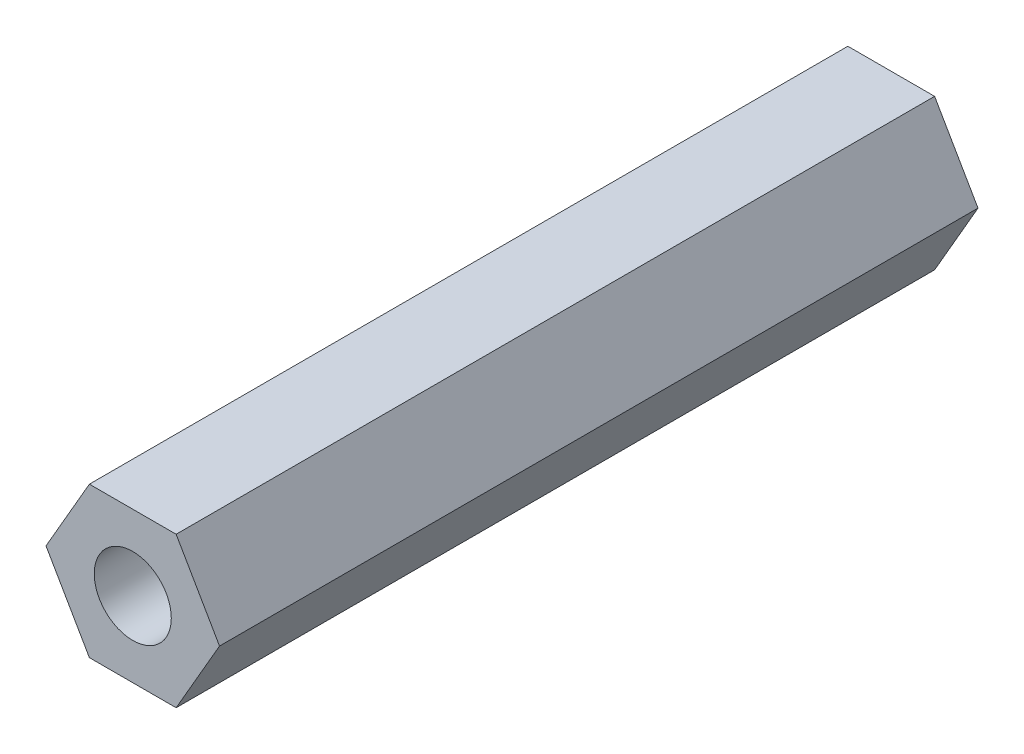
ISO-10303-21;
HEADER;
FILE_DESCRIPTION(('STEP AP214'),'2;1');
FILE_NAME('part.step','',(''),(''),'','','');
FILE_SCHEMA(('AUTOMOTIVE_DESIGN { 1 0 10303 214 1 1 1 1 }'));
ENDSEC;
DATA;
#1=APPLICATION_CONTEXT('core data for automotive mechanical design processes');
#2=APPLICATION_PROTOCOL_DEFINITION('international standard','automotive_design',2000,#1);
#3=PRODUCT_CONTEXT('',#1,'mechanical');
#4=PRODUCT('Part','Part','',(#3));
#5=PRODUCT_RELATED_PRODUCT_CATEGORY('part','',(#4));
#6=PRODUCT_DEFINITION_FORMATION('','',#4);
#7=PRODUCT_DEFINITION_CONTEXT('part definition',#1,'design');
#8=PRODUCT_DEFINITION('design','',#6,#7);
#9=PRODUCT_DEFINITION_SHAPE('','',#8);
#10=(LENGTH_UNIT() NAMED_UNIT(*) SI_UNIT(.MILLI.,.METRE.));
#11=(NAMED_UNIT(*) PLANE_ANGLE_UNIT() SI_UNIT($,.RADIAN.));
#12=(NAMED_UNIT(*) SI_UNIT($,.STERADIAN.) SOLID_ANGLE_UNIT());
#13=UNCERTAINTY_MEASURE_WITH_UNIT(LENGTH_MEASURE(1.E-05),#10,'distance_accuracy_value','');
#14=(GEOMETRIC_REPRESENTATION_CONTEXT(3) GLOBAL_UNCERTAINTY_ASSIGNED_CONTEXT((#13)) GLOBAL_UNIT_ASSIGNED_CONTEXT((#10,
#11,#12)) REPRESENTATION_CONTEXT('',''));
#15=CARTESIAN_POINT('',(0.,0.,0.));
#16=DIRECTION('',(0.,0.,1.));
#17=DIRECTION('',(1.,0.,0.));
#18=AXIS2_PLACEMENT_3D('',#15,#16,#17);
#19=CARTESIAN_POINT('',(2.28769270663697,0.,10.));
#20=DIRECTION('',(-0.866025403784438,-0.5,0.));
#21=DIRECTION('',(0.5,-0.866025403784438,0.));
#22=AXIS2_PLACEMENT_3D('',#19,#20,#21);
#23=PLANE('',#22);
#24=DIRECTION('',(-0.5,0.866025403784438,0.));
#25=VECTOR('',#24,1.);
#26=CARTESIAN_POINT('',(2.28769270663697,0.,-10.));
#27=LINE('',#26,#25);
#28=CARTESIAN_POINT('',(2.28769270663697,0.,-10.));
#29=VERTEX_POINT('',#28);
#30=CARTESIAN_POINT('',(1.14384635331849,1.9812,-10.));
#31=VERTEX_POINT('',#30);
#32=EDGE_CURVE('E126',#29,#31,#27,.T.);
#33=ORIENTED_EDGE('',*,*,#32,.T.);
#34=DIRECTION('',(0.,0.,-1.));
#35=VECTOR('',#34,1.);
#36=CARTESIAN_POINT('',(1.14384635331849,1.9812,10.));
#37=LINE('',#36,#35);
#38=CARTESIAN_POINT('',(1.14384635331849,1.9812,10.));
#39=VERTEX_POINT('',#38);
#40=EDGE_CURVE('E11',#39,#31,#37,.T.);
#41=ORIENTED_EDGE('',*,*,#40,.F.);
#42=DIRECTION('',(-0.5,0.866025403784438,0.));
#43=VECTOR('',#42,1.);
#44=CARTESIAN_POINT('',(2.28769270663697,0.,10.));
#45=LINE('',#44,#43);
#46=CARTESIAN_POINT('',(2.28769270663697,0.,10.));
#47=VERTEX_POINT('',#46);
#48=EDGE_CURVE('E137',#47,#39,#45,.T.);
#49=ORIENTED_EDGE('',*,*,#48,.F.);
#50=DIRECTION('',(0.,0.,-1.));
#51=VECTOR('',#50,1.);
#52=CARTESIAN_POINT('',(2.28769270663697,0.,10.));
#53=LINE('',#52,#51);
#54=EDGE_CURVE('E122',#47,#29,#53,.T.);
#55=ORIENTED_EDGE('',*,*,#54,.T.);
#56=EDGE_LOOP('',(#33,#41,#49,#55));
#57=FACE_BOUND('',#56,.T.);
#58=ADVANCED_FACE('F42',(#57),#23,.F.);
#59=CARTESIAN_POINT('',(1.14384635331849,1.9812,10.));
#60=DIRECTION('',(0.,-1.,0.));
#61=DIRECTION('',(0.,0.,-1.));
#62=AXIS2_PLACEMENT_3D('',#59,#60,#61);
#63=PLANE('',#62);
#64=DIRECTION('',(-1.,0.,0.));
#65=VECTOR('',#64,1.);
#66=CARTESIAN_POINT('',(1.14384635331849,1.9812,-10.));
#67=LINE('',#66,#65);
#68=CARTESIAN_POINT('',(-1.14384635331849,1.9812,-10.));
#69=VERTEX_POINT('',#68);
#70=EDGE_CURVE('E129',#31,#69,#67,.T.);
#71=ORIENTED_EDGE('',*,*,#70,.T.);
#72=DIRECTION('',(0.,0.,-1.));
#73=VECTOR('',#72,1.);
#74=CARTESIAN_POINT('',(-1.14384635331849,1.9812,10.));
#75=LINE('',#74,#73);
#76=CARTESIAN_POINT('',(-1.14384635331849,1.9812,10.));
#77=VERTEX_POINT('',#76);
#78=EDGE_CURVE('E50',#77,#69,#75,.T.);
#79=ORIENTED_EDGE('',*,*,#78,.F.);
#80=DIRECTION('',(-1.,0.,0.));
#81=VECTOR('',#80,1.);
#82=CARTESIAN_POINT('',(1.14384635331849,1.9812,10.));
#83=LINE('',#82,#81);
#84=EDGE_CURVE('E95',#39,#77,#83,.T.);
#85=ORIENTED_EDGE('',*,*,#84,.F.);
#86=ORIENTED_EDGE('',*,*,#40,.T.);
#87=EDGE_LOOP('',(#71,#79,#85,#86));
#88=FACE_BOUND('',#87,.T.);
#89=ADVANCED_FACE('F162',(#88),#63,.F.);
#90=CARTESIAN_POINT('',(-1.14384635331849,1.9812,10.));
#91=DIRECTION('',(0.866025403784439,-0.5,0.));
#92=DIRECTION('',(0.5,0.866025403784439,0.));
#93=AXIS2_PLACEMENT_3D('',#90,#91,#92);
#94=PLANE('',#93);
#95=DIRECTION('',(-0.5,-0.866025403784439,0.));
#96=VECTOR('',#95,1.);
#97=CARTESIAN_POINT('',(-1.14384635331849,1.9812,-10.));
#98=LINE('',#97,#96);
#99=CARTESIAN_POINT('',(-2.28769270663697,0.,-10.));
#100=VERTEX_POINT('',#99);
#101=EDGE_CURVE('E132',#69,#100,#98,.T.);
#102=ORIENTED_EDGE('',*,*,#101,.T.);
#103=DIRECTION('',(0.,0.,-1.));
#104=VECTOR('',#103,1.);
#105=CARTESIAN_POINT('',(-2.28769270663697,0.,10.));
#106=LINE('',#105,#104);
#107=CARTESIAN_POINT('',(-2.28769270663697,0.,10.));
#108=VERTEX_POINT('',#107);
#109=EDGE_CURVE('E117',#108,#100,#106,.T.);
#110=ORIENTED_EDGE('',*,*,#109,.F.);
#111=DIRECTION('',(-0.5,-0.866025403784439,0.));
#112=VECTOR('',#111,1.);
#113=CARTESIAN_POINT('',(-1.14384635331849,1.9812,10.));
#114=LINE('',#113,#112);
#115=EDGE_CURVE('E108',#77,#108,#114,.T.);
#116=ORIENTED_EDGE('',*,*,#115,.F.);
#117=ORIENTED_EDGE('',*,*,#78,.T.);
#118=EDGE_LOOP('',(#102,#110,#116,#117));
#119=FACE_BOUND('',#118,.T.);
#120=ADVANCED_FACE('F143',(#119),#94,.F.);
#121=CARTESIAN_POINT('',(-2.28769270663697,0.,10.));
#122=DIRECTION('',(0.866025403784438,0.500000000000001,0.));
#123=DIRECTION('',(-0.500000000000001,0.866025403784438,0.));
#124=AXIS2_PLACEMENT_3D('',#121,#122,#123);
#125=PLANE('',#124);
#126=DIRECTION('',(0.500000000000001,-0.866025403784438,0.));
#127=VECTOR('',#126,1.);
#128=CARTESIAN_POINT('',(-2.28769270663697,0.,-10.));
#129=LINE('',#128,#127);
#130=CARTESIAN_POINT('',(-1.14384635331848,-1.9812,-10.));
#131=VERTEX_POINT('',#130);
#132=EDGE_CURVE('E116',#100,#131,#129,.T.);
#133=ORIENTED_EDGE('',*,*,#132,.T.);
#134=DIRECTION('',(0.,0.,-1.));
#135=VECTOR('',#134,1.);
#136=CARTESIAN_POINT('',(-1.14384635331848,-1.9812,10.));
#137=LINE('',#136,#135);
#138=CARTESIAN_POINT('',(-1.14384635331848,-1.9812,10.));
#139=VERTEX_POINT('',#138);
#140=EDGE_CURVE('E113',#139,#131,#137,.T.);
#141=ORIENTED_EDGE('',*,*,#140,.F.);
#142=DIRECTION('',(0.500000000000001,-0.866025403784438,0.));
#143=VECTOR('',#142,1.);
#144=CARTESIAN_POINT('',(-2.28769270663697,0.,10.));
#145=LINE('',#144,#143);
#146=EDGE_CURVE('E102',#108,#139,#145,.T.);
#147=ORIENTED_EDGE('',*,*,#146,.F.);
#148=ORIENTED_EDGE('',*,*,#109,.T.);
#149=EDGE_LOOP('',(#133,#141,#147,#148));
#150=FACE_BOUND('',#149,.T.);
#151=ADVANCED_FACE('F114',(#150),#125,.F.);
#152=CARTESIAN_POINT('',(-1.14384635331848,-1.9812,10.));
#153=DIRECTION('',(0.,1.,0.));
#154=DIRECTION('',(-1.,0.,0.));
#155=AXIS2_PLACEMENT_3D('',#152,#153,#154);
#156=PLANE('',#155);
#157=DIRECTION('',(1.,0.,0.));
#158=VECTOR('',#157,1.);
#159=CARTESIAN_POINT('',(-1.14384635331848,-1.9812,-10.));
#160=LINE('',#159,#158);
#161=CARTESIAN_POINT('',(1.14384635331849,-1.9812,-10.));
#162=VERTEX_POINT('',#161);
#163=EDGE_CURVE('E81',#131,#162,#160,.T.);
#164=ORIENTED_EDGE('',*,*,#163,.T.);
#165=DIRECTION('',(0.,0.,-1.));
#166=VECTOR('',#165,1.);
#167=CARTESIAN_POINT('',(1.14384635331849,-1.9812,10.));
#168=LINE('',#167,#166);
#169=CARTESIAN_POINT('',(1.14384635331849,-1.9812,10.));
#170=VERTEX_POINT('',#169);
#171=EDGE_CURVE('E118',#170,#162,#168,.T.);
#172=ORIENTED_EDGE('',*,*,#171,.F.);
#173=DIRECTION('',(1.,0.,0.));
#174=VECTOR('',#173,1.);
#175=CARTESIAN_POINT('',(-1.14384635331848,-1.9812,10.));
#176=LINE('',#175,#174);
#177=EDGE_CURVE('E106',#139,#170,#176,.T.);
#178=ORIENTED_EDGE('',*,*,#177,.F.);
#179=ORIENTED_EDGE('',*,*,#140,.T.);
#180=EDGE_LOOP('',(#164,#172,#178,#179));
#181=FACE_BOUND('',#180,.T.);
#182=ADVANCED_FACE('F120',(#181),#156,.F.);
#183=CARTESIAN_POINT('',(1.14384635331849,-1.9812,10.));
#184=DIRECTION('',(-0.866025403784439,0.5,0.));
#185=DIRECTION('',(-0.5,-0.866025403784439,0.));
#186=AXIS2_PLACEMENT_3D('',#183,#184,#185);
#187=PLANE('',#186);
#188=DIRECTION('',(0.5,0.866025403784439,0.));
#189=VECTOR('',#188,1.);
#190=CARTESIAN_POINT('',(1.14384635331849,-1.9812,-10.));
#191=LINE('',#190,#189);
#192=EDGE_CURVE('E87',#162,#29,#191,.T.);
#193=ORIENTED_EDGE('',*,*,#192,.T.);
#194=ORIENTED_EDGE('',*,*,#54,.F.);
#195=DIRECTION('',(0.5,0.866025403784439,0.));
#196=VECTOR('',#195,1.);
#197=CARTESIAN_POINT('',(1.14384635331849,-1.9812,10.));
#198=LINE('',#197,#196);
#199=EDGE_CURVE('E58',#170,#47,#198,.T.);
#200=ORIENTED_EDGE('',*,*,#199,.F.);
#201=ORIENTED_EDGE('',*,*,#171,.T.);
#202=EDGE_LOOP('',(#193,#194,#200,#201));
#203=FACE_BOUND('',#202,.T.);
#204=ADVANCED_FACE('F150',(#203),#187,.F.);
#205=CARTESIAN_POINT('',(0.,0.,10.));
#206=DIRECTION('',(0.,0.,1.));
#207=DIRECTION('',(1.,0.,0.));
#208=AXIS2_PLACEMENT_3D('',#205,#206,#207);
#209=PLANE('',#208);
#210=CARTESIAN_POINT('',(0.,0.,10.));
#211=DIRECTION('',(0.,0.,1.));
#212=DIRECTION('',(1.,0.,0.));
#213=AXIS2_PLACEMENT_3D('',#210,#211,#212);
#214=CIRCLE('',#213,1.016);
#215=CARTESIAN_POINT('',(1.016,0.,10.));
#216=VERTEX_POINT('',#215);
#217=EDGE_CURVE('E130',#216,#216,#214,.T.);
#218=ORIENTED_EDGE('',*,*,#217,.F.);
#219=EDGE_LOOP('',(#218));
#220=FACE_BOUND('',#219,.T.);
#221=ORIENTED_EDGE('',*,*,#48,.T.);
#222=ORIENTED_EDGE('',*,*,#84,.T.);
#223=ORIENTED_EDGE('',*,*,#115,.T.);
#224=ORIENTED_EDGE('',*,*,#146,.T.);
#225=ORIENTED_EDGE('',*,*,#177,.T.);
#226=ORIENTED_EDGE('',*,*,#199,.T.);
#227=EDGE_LOOP('',(#221,#222,#223,#224,#225,#226));
#228=FACE_BOUND('',#227,.T.);
#229=ADVANCED_FACE('F104',(#220,#228),#209,.T.);
#230=CARTESIAN_POINT('',(0.,0.,-10.));
#231=DIRECTION('',(0.,0.,1.));
#232=DIRECTION('',(1.,0.,0.));
#233=AXIS2_PLACEMENT_3D('',#230,#231,#232);
#234=PLANE('',#233);
#235=CARTESIAN_POINT('',(0.,0.,-10.));
#236=DIRECTION('',(0.,0.,1.));
#237=DIRECTION('',(1.,0.,0.));
#238=AXIS2_PLACEMENT_3D('',#235,#236,#237);
#239=CIRCLE('',#238,1.016);
#240=CARTESIAN_POINT('',(1.016,0.,-10.));
#241=VERTEX_POINT('',#240);
#242=EDGE_CURVE('E217',#241,#241,#239,.T.);
#243=ORIENTED_EDGE('',*,*,#242,.T.);
#244=EDGE_LOOP('',(#243));
#245=FACE_BOUND('',#244,.T.);
#246=ORIENTED_EDGE('',*,*,#32,.F.);
#247=ORIENTED_EDGE('',*,*,#192,.F.);
#248=ORIENTED_EDGE('',*,*,#163,.F.);
#249=ORIENTED_EDGE('',*,*,#132,.F.);
#250=ORIENTED_EDGE('',*,*,#101,.F.);
#251=ORIENTED_EDGE('',*,*,#70,.F.);
#252=EDGE_LOOP('',(#246,#247,#248,#249,#250,#251));
#253=FACE_BOUND('',#252,.T.);
#254=ADVANCED_FACE('F146',(#245,#253),#234,.F.);
#255=CARTESIAN_POINT('',(0.,0.,-10.));
#256=DIRECTION('',(0.,0.,1.));
#257=DIRECTION('',(1.,0.,0.));
#258=AXIS2_PLACEMENT_3D('',#255,#256,#257);
#259=CYLINDRICAL_SURFACE('',#258,1.016);
#260=ORIENTED_EDGE('',*,*,#217,.T.);
#261=EDGE_LOOP('',(#260));
#262=FACE_BOUND('',#261,.T.);
#263=ORIENTED_EDGE('',*,*,#242,.F.);
#264=EDGE_LOOP('',(#263));
#265=FACE_BOUND('',#264,.T.);
#266=ADVANCED_FACE('F199',(#262,#265),#259,.F.);
#267=CLOSED_SHELL('',(#58,#89,#120,#151,#182,#204,#229,#254,#266));
#268=MANIFOLD_SOLID_BREP('B2',#267);
#269=ADVANCED_BREP_SHAPE_REPRESENTATION('',(#18,#268),#14);
#270=SHAPE_DEFINITION_REPRESENTATION(#9,#269);
ENDSEC;
END-ISO-10303-21;
